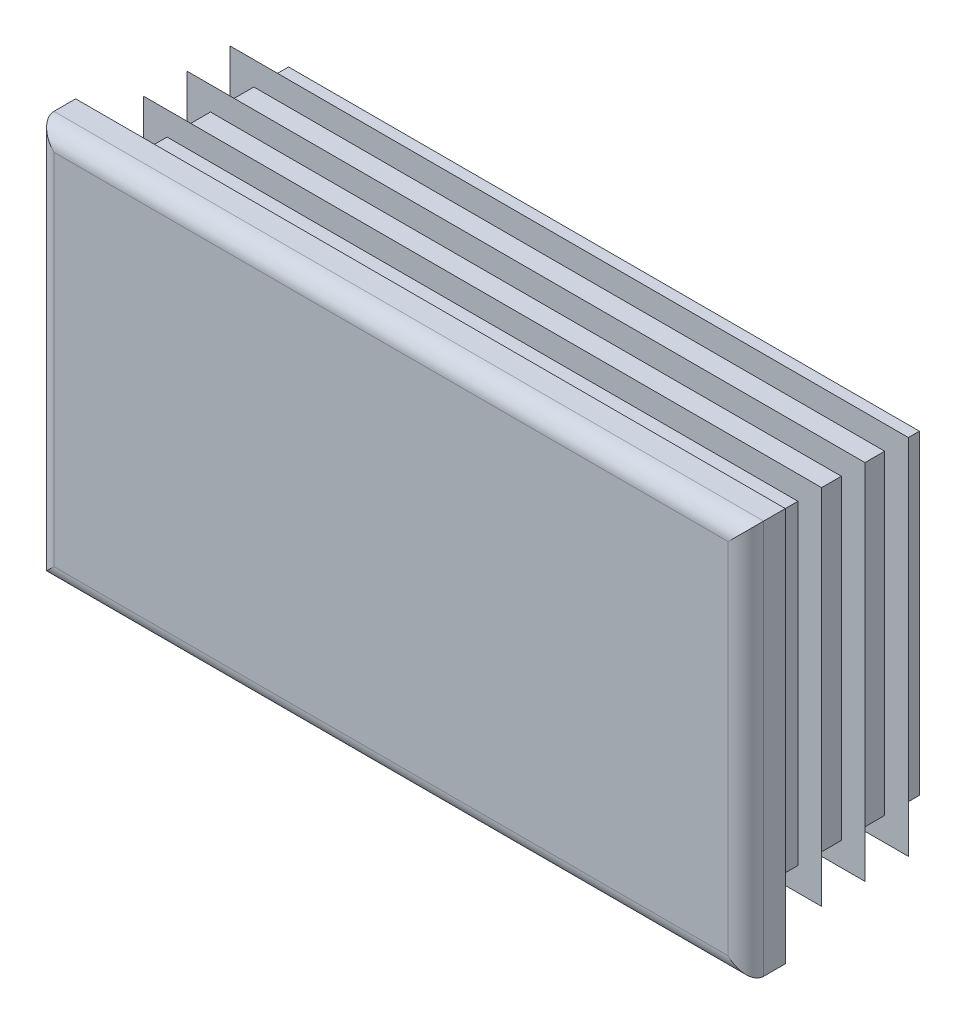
ISO-10303-21;
HEADER;
FILE_DESCRIPTION(('STEP AP214'),'2;1');
FILE_NAME('part.step','',(''),(''),'','','');
FILE_SCHEMA(('AUTOMOTIVE_DESIGN { 1 0 10303 214 1 1 1 1 }'));
ENDSEC;
DATA;
#1=APPLICATION_CONTEXT('core data for automotive mechanical design processes');
#2=APPLICATION_PROTOCOL_DEFINITION('international standard','automotive_design',2000,#1);
#3=PRODUCT_CONTEXT('',#1,'mechanical');
#4=PRODUCT('Part','Part','',(#3));
#5=PRODUCT_RELATED_PRODUCT_CATEGORY('part','',(#4));
#6=PRODUCT_DEFINITION_FORMATION('','',#4);
#7=PRODUCT_DEFINITION_CONTEXT('part definition',#1,'design');
#8=PRODUCT_DEFINITION('design','',#6,#7);
#9=PRODUCT_DEFINITION_SHAPE('','',#8);
#10=(LENGTH_UNIT() NAMED_UNIT(*) SI_UNIT(.MILLI.,.METRE.));
#11=(NAMED_UNIT(*) PLANE_ANGLE_UNIT() SI_UNIT($,.RADIAN.));
#12=(NAMED_UNIT(*) SI_UNIT($,.STERADIAN.) SOLID_ANGLE_UNIT());
#13=UNCERTAINTY_MEASURE_WITH_UNIT(LENGTH_MEASURE(1.E-05),#10,'distance_accuracy_value','');
#14=(GEOMETRIC_REPRESENTATION_CONTEXT(3) GLOBAL_UNCERTAINTY_ASSIGNED_CONTEXT((#13)) GLOBAL_UNIT_ASSIGNED_CONTEXT((#10,
#11,#12)) REPRESENTATION_CONTEXT('',''));
#15=CARTESIAN_POINT('',(0.,0.,0.));
#16=DIRECTION('',(0.,0.,1.));
#17=DIRECTION('',(1.,0.,0.));
#18=AXIS2_PLACEMENT_3D('',#15,#16,#17);
#19=CARTESIAN_POINT('',(42.75,-25.,5.));
#20=DIRECTION('',(0.,0.,-1.));
#21=DIRECTION('',(0.,1.,0.));
#22=AXIS2_PLACEMENT_3D('',#19,#20,#21);
#23=PLANE('',#22);
#24=DIRECTION('',(0.,1.,0.));
#25=VECTOR('',#24,1.);
#26=CARTESIAN_POINT('',(-42.75,-25.,5.));
#27=LINE('',#26,#25);
#28=CARTESIAN_POINT('',(-42.75,-22.75,5.));
#29=VERTEX_POINT('',#28);
#30=CARTESIAN_POINT('',(-42.75,22.75,5.));
#31=VERTEX_POINT('',#30);
#32=EDGE_CURVE('E310',#29,#31,#27,.T.);
#33=ORIENTED_EDGE('',*,*,#32,.F.);
#34=DIRECTION('',(-1.,0.,0.));
#35=VECTOR('',#34,1.);
#36=CARTESIAN_POINT('',(45.,-22.75,5.));
#37=LINE('',#36,#35);
#38=CARTESIAN_POINT('',(42.75,-22.75,5.));
#39=VERTEX_POINT('',#38);
#40=EDGE_CURVE('E482',#39,#29,#37,.T.);
#41=ORIENTED_EDGE('',*,*,#40,.F.);
#42=DIRECTION('',(0.,1.,0.));
#43=VECTOR('',#42,1.);
#44=CARTESIAN_POINT('',(42.75,-25.,5.));
#45=LINE('',#44,#43);
#46=CARTESIAN_POINT('',(42.75,22.75,5.));
#47=VERTEX_POINT('',#46);
#48=EDGE_CURVE('E305',#39,#47,#45,.T.);
#49=ORIENTED_EDGE('',*,*,#48,.T.);
#50=DIRECTION('',(-1.,0.,0.));
#51=VECTOR('',#50,1.);
#52=CARTESIAN_POINT('',(45.,22.75,5.));
#53=LINE('',#52,#51);
#54=EDGE_CURVE('E630',#47,#31,#53,.T.);
#55=ORIENTED_EDGE('',*,*,#54,.T.);
#56=EDGE_LOOP('',(#33,#41,#49,#55));
#57=FACE_BOUND('',#56,.T.);
#58=ADVANCED_FACE('F14',(#57),#23,.F.);
#59=CARTESIAN_POINT('',(-42.75,-25.,2.75));
#60=DIRECTION('',(0.,1.,0.));
#61=DIRECTION('',(-1.,0.,0.));
#62=AXIS2_PLACEMENT_3D('',#59,#60,#61);
#63=CYLINDRICAL_SURFACE('',#62,2.25);
#64=DIRECTION('',(0.,1.,0.));
#65=VECTOR('',#64,1.);
#66=CARTESIAN_POINT('',(-45.,-25.,2.75));
#67=LINE('',#66,#65);
#68=CARTESIAN_POINT('',(-45.,-25.,2.75));
#69=VERTEX_POINT('',#68);
#70=CARTESIAN_POINT('',(-45.,25.,2.75));
#71=VERTEX_POINT('',#70);
#72=EDGE_CURVE('E402',#69,#71,#67,.T.);
#73=ORIENTED_EDGE('',*,*,#72,.F.);
#74=CARTESIAN_POINT('',(-42.75,-22.75,2.75));
#75=DIRECTION('',(-0.707106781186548,0.707106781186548,0.));
#76=DIRECTION('',(0.707106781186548,0.707106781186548,0.));
#77=AXIS2_PLACEMENT_3D('',#74,#75,#76);
#78=ELLIPSE('',#77,3.18198051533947,2.25);
#79=EDGE_CURVE('E59',#69,#29,#78,.T.);
#80=ORIENTED_EDGE('',*,*,#79,.T.);
#81=ORIENTED_EDGE('',*,*,#32,.T.);
#82=CARTESIAN_POINT('',(-42.75,22.75,2.75));
#83=DIRECTION('',(0.707106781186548,0.707106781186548,0.));
#84=DIRECTION('',(-0.707106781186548,0.707106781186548,0.));
#85=AXIS2_PLACEMENT_3D('',#82,#83,#84);
#86=ELLIPSE('',#85,3.18198051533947,2.25);
#87=EDGE_CURVE('E306',#31,#71,#86,.F.);
#88=ORIENTED_EDGE('',*,*,#87,.T.);
#89=EDGE_LOOP('',(#73,#80,#81,#88));
#90=FACE_BOUND('',#89,.T.);
#91=ADVANCED_FACE('F16',(#90),#63,.T.);
#92=CARTESIAN_POINT('',(-45.,-25.,2.75));
#93=DIRECTION('',(1.,0.,0.));
#94=DIRECTION('',(0.,1.,0.));
#95=AXIS2_PLACEMENT_3D('',#92,#93,#94);
#96=PLANE('',#95);
#97=DIRECTION('',(0.,0.,-1.));
#98=VECTOR('',#97,1.);
#99=CARTESIAN_POINT('',(-45.,25.,2.75));
#100=LINE('',#99,#98);
#101=CARTESIAN_POINT('',(-45.,25.,0.));
#102=VERTEX_POINT('',#101);
#103=EDGE_CURVE('E615',#71,#102,#100,.T.);
#104=ORIENTED_EDGE('',*,*,#103,.T.);
#105=DIRECTION('',(0.,1.,0.));
#106=VECTOR('',#105,1.);
#107=CARTESIAN_POINT('',(-45.,-25.,0.));
#108=LINE('',#107,#106);
#109=CARTESIAN_POINT('',(-45.,-25.,0.));
#110=VERTEX_POINT('',#109);
#111=EDGE_CURVE('E400',#110,#102,#108,.T.);
#112=ORIENTED_EDGE('',*,*,#111,.F.);
#113=DIRECTION('',(0.,0.,-1.));
#114=VECTOR('',#113,1.);
#115=CARTESIAN_POINT('',(-45.,-25.,2.75));
#116=LINE('',#115,#114);
#117=EDGE_CURVE('E616',#69,#110,#116,.T.);
#118=ORIENTED_EDGE('',*,*,#117,.F.);
#119=ORIENTED_EDGE('',*,*,#72,.T.);
#120=EDGE_LOOP('',(#104,#112,#118,#119));
#121=FACE_BOUND('',#120,.T.);
#122=ADVANCED_FACE('F697',(#121),#96,.F.);
#123=CARTESIAN_POINT('',(-40.,-25.,0.));
#124=DIRECTION('',(1.,0.,0.));
#125=DIRECTION('',(0.,1.,0.));
#126=AXIS2_PLACEMENT_3D('',#123,#124,#125);
#127=PLANE('',#126);
#128=DIRECTION('',(0.,1.,0.));
#129=VECTOR('',#128,1.);
#130=CARTESIAN_POINT('',(-40.,-25.,0.));
#131=LINE('',#130,#129);
#132=CARTESIAN_POINT('',(-40.,-20.,0.));
#133=VERTEX_POINT('',#132);
#134=CARTESIAN_POINT('',(-40.,20.,0.));
#135=VERTEX_POINT('',#134);
#136=EDGE_CURVE('E397',#133,#135,#131,.T.);
#137=ORIENTED_EDGE('',*,*,#136,.T.);
#138=DIRECTION('',(0.,0.,-1.));
#139=VECTOR('',#138,1.);
#140=CARTESIAN_POINT('',(-40.,20.,0.));
#141=LINE('',#140,#139);
#142=CARTESIAN_POINT('',(-40.,20.,-1.1));
#143=VERTEX_POINT('',#142);
#144=EDGE_CURVE('E495',#135,#143,#141,.T.);
#145=ORIENTED_EDGE('',*,*,#144,.T.);
#146=DIRECTION('',(0.,1.,0.));
#147=VECTOR('',#146,1.);
#148=CARTESIAN_POINT('',(-40.,-25.,-1.1));
#149=LINE('',#148,#147);
#150=CARTESIAN_POINT('',(-40.,-20.,-1.1));
#151=VERTEX_POINT('',#150);
#152=EDGE_CURVE('E394',#151,#143,#149,.T.);
#153=ORIENTED_EDGE('',*,*,#152,.F.);
#154=DIRECTION('',(0.,0.,1.));
#155=VECTOR('',#154,1.);
#156=CARTESIAN_POINT('',(-40.,-20.,0.));
#157=LINE('',#156,#155);
#158=EDGE_CURVE('E489',#151,#133,#157,.T.);
#159=ORIENTED_EDGE('',*,*,#158,.T.);
#160=EDGE_LOOP('',(#137,#145,#153,#159));
#161=FACE_BOUND('',#160,.T.);
#162=ADVANCED_FACE('F787',(#161),#127,.F.);
#163=CARTESIAN_POINT('',(-43.,-25.,-1.1));
#164=DIRECTION('',(0.342020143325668,0.,0.939692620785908));
#165=DIRECTION('',(-0.939692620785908,0.,0.342020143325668));
#166=AXIS2_PLACEMENT_3D('',#163,#164,#165);
#167=PLANE('',#166);
#168=DIRECTION('',(0.,1.,0.));
#169=VECTOR('',#168,1.);
#170=CARTESIAN_POINT('',(-43.,-25.,-1.1));
#171=LINE('',#170,#169);
#172=CARTESIAN_POINT('',(-43.,-23.,-1.1));
#173=VERTEX_POINT('',#172);
#174=CARTESIAN_POINT('',(-43.,23.,-1.1));
#175=VERTEX_POINT('',#174);
#176=EDGE_CURVE('E392',#173,#175,#171,.T.);
#177=ORIENTED_EDGE('',*,*,#176,.T.);
#178=DIRECTION('',(0.844349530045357,-0.438895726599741,-0.307318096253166));
#179=VECTOR('',#178,1.);
#180=CARTESIAN_POINT('',(-25.2120927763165,13.7537859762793,-7.57426875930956));
#181=LINE('',#180,#179);
#182=CARTESIAN_POINT('',(-40.,21.4405899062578,-2.19191070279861));
#183=VERTEX_POINT('',#182);
#184=EDGE_CURVE('E519',#175,#183,#181,.T.);
#185=ORIENTED_EDGE('',*,*,#184,.T.);
#186=DIRECTION('',(0.,1.,0.));
#187=VECTOR('',#186,1.);
#188=CARTESIAN_POINT('',(-40.,-25.,-2.19191070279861));
#189=LINE('',#188,#187);
#190=CARTESIAN_POINT('',(-40.,-21.4405899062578,-2.19191070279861));
#191=VERTEX_POINT('',#190);
#192=EDGE_CURVE('E389',#191,#183,#189,.T.);
#193=ORIENTED_EDGE('',*,*,#192,.F.);
#194=DIRECTION('',(-0.844349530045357,-0.438895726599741,0.307318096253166));
#195=VECTOR('',#194,1.);
#196=CARTESIAN_POINT('',(-43.7411628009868,-23.3852589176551,-0.830238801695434));
#197=LINE('',#196,#195);
#198=EDGE_CURVE('E507',#191,#173,#197,.T.);
#199=ORIENTED_EDGE('',*,*,#198,.T.);
#200=EDGE_LOOP('',(#177,#185,#193,#199));
#201=FACE_BOUND('',#200,.T.);
#202=ADVANCED_FACE('F783',(#201),#167,.F.);
#203=CARTESIAN_POINT('',(-40.,-25.,-2.19191070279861));
#204=DIRECTION('',(1.,0.,0.));
#205=DIRECTION('',(0.,1.,0.));
#206=AXIS2_PLACEMENT_3D('',#203,#204,#205);
#207=PLANE('',#206);
#208=ORIENTED_EDGE('',*,*,#192,.T.);
#209=DIRECTION('',(0.,-0.819152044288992,-0.573576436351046));
#210=VECTOR('',#209,1.);
#211=CARTESIAN_POINT('',(-40.,-9.72151365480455,-24.0118505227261));
#212=LINE('',#211,#210);
#213=CARTESIAN_POINT('',(-40.,20.,-3.20062261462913));
#214=VERTEX_POINT('',#213);
#215=EDGE_CURVE('E516',#183,#214,#212,.T.);
#216=ORIENTED_EDGE('',*,*,#215,.T.);
#217=DIRECTION('',(0.,0.,-1.));
#218=VECTOR('',#217,1.);
#219=CARTESIAN_POINT('',(-40.,20.,-2.19191070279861));
#220=LINE('',#219,#218);
#221=CARTESIAN_POINT('',(-40.,20.,-6.6));
#222=VERTEX_POINT('',#221);
#223=EDGE_CURVE('E525',#214,#222,#220,.T.);
#224=ORIENTED_EDGE('',*,*,#223,.T.);
#225=DIRECTION('',(0.,1.,0.));
#226=VECTOR('',#225,1.);
#227=CARTESIAN_POINT('',(-40.,-25.,-6.6));
#228=LINE('',#227,#226);
#229=CARTESIAN_POINT('',(-40.,-20.,-6.6));
#230=VERTEX_POINT('',#229);
#231=EDGE_CURVE('E386',#230,#222,#228,.T.);
#232=ORIENTED_EDGE('',*,*,#231,.F.);
#233=DIRECTION('',(0.,0.,1.));
#234=VECTOR('',#233,1.);
#235=CARTESIAN_POINT('',(-40.,-20.,-2.19191070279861));
#236=LINE('',#235,#234);
#237=CARTESIAN_POINT('',(-40.,-20.,-3.20062261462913));
#238=VERTEX_POINT('',#237);
#239=EDGE_CURVE('E522',#230,#238,#236,.T.);
#240=ORIENTED_EDGE('',*,*,#239,.T.);
#241=DIRECTION('',(0.,-0.819152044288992,0.573576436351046));
#242=VECTOR('',#241,1.);
#243=CARTESIAN_POINT('',(-40.,-23.8289899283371,-0.519535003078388));
#244=LINE('',#243,#242);
#245=EDGE_CURVE('E504',#238,#191,#244,.T.);
#246=ORIENTED_EDGE('',*,*,#245,.T.);
#247=EDGE_LOOP('',(#208,#216,#224,#232,#240,#246));
#248=FACE_BOUND('',#247,.T.);
#249=ADVANCED_FACE('F779',(#248),#207,.F.);
#250=CARTESIAN_POINT('',(-43.,-25.,-6.6));
#251=DIRECTION('',(0.342020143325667,0.,0.939692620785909));
#252=DIRECTION('',(-0.939692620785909,0.,0.342020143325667));
#253=AXIS2_PLACEMENT_3D('',#250,#251,#252);
#254=PLANE('',#253);
#255=DIRECTION('',(0.,1.,0.));
#256=VECTOR('',#255,1.);
#257=CARTESIAN_POINT('',(-43.,-25.,-6.6));
#258=LINE('',#257,#256);
#259=CARTESIAN_POINT('',(-43.,-23.,-6.6));
#260=VERTEX_POINT('',#259);
#261=CARTESIAN_POINT('',(-43.,23.,-6.6));
#262=VERTEX_POINT('',#261);
#263=EDGE_CURVE('E384',#260,#262,#258,.T.);
#264=ORIENTED_EDGE('',*,*,#263,.T.);
#265=DIRECTION('',(0.844349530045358,-0.438895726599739,-0.307318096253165));
#266=VECTOR('',#265,1.);
#267=CARTESIAN_POINT('',(-25.2120927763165,13.7537859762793,-13.0742687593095));
#268=LINE('',#267,#266);
#269=CARTESIAN_POINT('',(-40.,21.4405899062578,-7.69191070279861));
#270=VERTEX_POINT('',#269);
#271=EDGE_CURVE('E549',#262,#270,#268,.T.);
#272=ORIENTED_EDGE('',*,*,#271,.T.);
#273=DIRECTION('',(0.,1.,0.));
#274=VECTOR('',#273,1.);
#275=CARTESIAN_POINT('',(-40.,-25.,-7.6919107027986));
#276=LINE('',#275,#274);
#277=CARTESIAN_POINT('',(-40.,-21.4405899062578,-7.6919107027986));
#278=VERTEX_POINT('',#277);
#279=EDGE_CURVE('E381',#278,#270,#276,.T.);
#280=ORIENTED_EDGE('',*,*,#279,.F.);
#281=DIRECTION('',(-0.844349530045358,-0.438895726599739,0.307318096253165));
#282=VECTOR('',#281,1.);
#283=CARTESIAN_POINT('',(-43.7411628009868,-23.3852589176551,-6.33023880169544));
#284=LINE('',#283,#282);
#285=EDGE_CURVE('E537',#278,#260,#284,.T.);
#286=ORIENTED_EDGE('',*,*,#285,.T.);
#287=EDGE_LOOP('',(#264,#272,#280,#286));
#288=FACE_BOUND('',#287,.T.);
#289=ADVANCED_FACE('F775',(#288),#254,.F.);
#290=CARTESIAN_POINT('',(-40.,-25.,-7.6919107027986));
#291=DIRECTION('',(1.,0.,0.));
#292=DIRECTION('',(0.,1.,0.));
#293=AXIS2_PLACEMENT_3D('',#290,#291,#292);
#294=PLANE('',#293);
#295=ORIENTED_EDGE('',*,*,#279,.T.);
#296=DIRECTION('',(0.,-0.819152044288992,-0.573576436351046));
#297=VECTOR('',#296,1.);
#298=CARTESIAN_POINT('',(-40.,-9.72151365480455,-29.5118505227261));
#299=LINE('',#298,#297);
#300=CARTESIAN_POINT('',(-40.,20.,-8.70062261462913));
#301=VERTEX_POINT('',#300);
#302=EDGE_CURVE('E546',#270,#301,#299,.T.);
#303=ORIENTED_EDGE('',*,*,#302,.T.);
#304=DIRECTION('',(0.,0.,-1.));
#305=VECTOR('',#304,1.);
#306=CARTESIAN_POINT('',(-40.,20.,-7.6919107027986));
#307=LINE('',#306,#305);
#308=CARTESIAN_POINT('',(-40.,20.,-12.1));
#309=VERTEX_POINT('',#308);
#310=EDGE_CURVE('E555',#301,#309,#307,.T.);
#311=ORIENTED_EDGE('',*,*,#310,.T.);
#312=DIRECTION('',(0.,1.,0.));
#313=VECTOR('',#312,1.);
#314=CARTESIAN_POINT('',(-40.,-25.,-12.1));
#315=LINE('',#314,#313);
#316=CARTESIAN_POINT('',(-40.,-20.,-12.1));
#317=VERTEX_POINT('',#316);
#318=EDGE_CURVE('E378',#317,#309,#315,.T.);
#319=ORIENTED_EDGE('',*,*,#318,.F.);
#320=DIRECTION('',(0.,0.,1.));
#321=VECTOR('',#320,1.);
#322=CARTESIAN_POINT('',(-40.,-20.,-7.6919107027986));
#323=LINE('',#322,#321);
#324=CARTESIAN_POINT('',(-40.,-20.,-8.70062261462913));
#325=VERTEX_POINT('',#324);
#326=EDGE_CURVE('E552',#317,#325,#323,.T.);
#327=ORIENTED_EDGE('',*,*,#326,.T.);
#328=DIRECTION('',(0.,-0.819152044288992,0.573576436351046));
#329=VECTOR('',#328,1.);
#330=CARTESIAN_POINT('',(-40.,-23.8289899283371,-6.01953500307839));
#331=LINE('',#330,#329);
#332=EDGE_CURVE('E534',#325,#278,#331,.T.);
#333=ORIENTED_EDGE('',*,*,#332,.T.);
#334=EDGE_LOOP('',(#295,#303,#311,#319,#327,#333));
#335=FACE_BOUND('',#334,.T.);
#336=ADVANCED_FACE('F771',(#335),#294,.F.);
#337=CARTESIAN_POINT('',(-43.,-25.,-12.1));
#338=DIRECTION('',(0.342020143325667,0.,0.939692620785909));
#339=DIRECTION('',(-0.939692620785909,0.,0.342020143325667));
#340=AXIS2_PLACEMENT_3D('',#337,#338,#339);
#341=PLANE('',#340);
#342=DIRECTION('',(0.,1.,0.));
#343=VECTOR('',#342,1.);
#344=CARTESIAN_POINT('',(-43.,-25.,-12.1));
#345=LINE('',#344,#343);
#346=CARTESIAN_POINT('',(-43.,-23.,-12.1));
#347=VERTEX_POINT('',#346);
#348=CARTESIAN_POINT('',(-43.,23.,-12.1));
#349=VERTEX_POINT('',#348);
#350=EDGE_CURVE('E376',#347,#349,#345,.T.);
#351=ORIENTED_EDGE('',*,*,#350,.T.);
#352=DIRECTION('',(0.844349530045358,-0.438895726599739,-0.307318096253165));
#353=VECTOR('',#352,1.);
#354=CARTESIAN_POINT('',(-25.2120927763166,13.7537859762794,-18.5742687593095));
#355=LINE('',#354,#353);
#356=CARTESIAN_POINT('',(-40.,21.4405899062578,-13.1919107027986));
#357=VERTEX_POINT('',#356);
#358=EDGE_CURVE('E579',#349,#357,#355,.T.);
#359=ORIENTED_EDGE('',*,*,#358,.T.);
#360=DIRECTION('',(0.,1.,0.));
#361=VECTOR('',#360,1.);
#362=CARTESIAN_POINT('',(-40.,-25.,-13.1919107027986));
#363=LINE('',#362,#361);
#364=CARTESIAN_POINT('',(-40.,-21.4405899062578,-13.1919107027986));
#365=VERTEX_POINT('',#364);
#366=EDGE_CURVE('E373',#365,#357,#363,.T.);
#367=ORIENTED_EDGE('',*,*,#366,.F.);
#368=DIRECTION('',(-0.844349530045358,-0.438895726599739,0.307318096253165));
#369=VECTOR('',#368,1.);
#370=CARTESIAN_POINT('',(-43.7411628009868,-23.3852589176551,-11.8302388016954));
#371=LINE('',#370,#369);
#372=EDGE_CURVE('E567',#365,#347,#371,.T.);
#373=ORIENTED_EDGE('',*,*,#372,.T.);
#374=EDGE_LOOP('',(#351,#359,#367,#373));
#375=FACE_BOUND('',#374,.T.);
#376=ADVANCED_FACE('F767',(#375),#341,.F.);
#377=CARTESIAN_POINT('',(-40.,-25.,-13.1919107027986));
#378=DIRECTION('',(1.,0.,0.));
#379=DIRECTION('',(0.,1.,0.));
#380=AXIS2_PLACEMENT_3D('',#377,#378,#379);
#381=PLANE('',#380);
#382=ORIENTED_EDGE('',*,*,#366,.T.);
#383=DIRECTION('',(0.,-0.819152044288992,-0.573576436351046));
#384=VECTOR('',#383,1.);
#385=CARTESIAN_POINT('',(-40.,-9.72151365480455,-35.0118505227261));
#386=LINE('',#385,#384);
#387=CARTESIAN_POINT('',(-40.,20.,-14.2006226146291));
#388=VERTEX_POINT('',#387);
#389=EDGE_CURVE('E576',#357,#388,#386,.T.);
#390=ORIENTED_EDGE('',*,*,#389,.T.);
#391=DIRECTION('',(0.,0.,-1.));
#392=VECTOR('',#391,1.);
#393=CARTESIAN_POINT('',(-40.,20.,-13.1919107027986));
#394=LINE('',#393,#392);
#395=CARTESIAN_POINT('',(-40.,20.,-17.6));
#396=VERTEX_POINT('',#395);
#397=EDGE_CURVE('E585',#388,#396,#394,.T.);
#398=ORIENTED_EDGE('',*,*,#397,.T.);
#399=DIRECTION('',(0.,1.,0.));
#400=VECTOR('',#399,1.);
#401=CARTESIAN_POINT('',(-40.,-25.,-17.6));
#402=LINE('',#401,#400);
#403=CARTESIAN_POINT('',(-40.,-20.,-17.6));
#404=VERTEX_POINT('',#403);
#405=EDGE_CURVE('E370',#404,#396,#402,.T.);
#406=ORIENTED_EDGE('',*,*,#405,.F.);
#407=DIRECTION('',(0.,0.,1.));
#408=VECTOR('',#407,1.);
#409=CARTESIAN_POINT('',(-40.,-20.,-13.1919107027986));
#410=LINE('',#409,#408);
#411=CARTESIAN_POINT('',(-40.,-20.,-14.2006226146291));
#412=VERTEX_POINT('',#411);
#413=EDGE_CURVE('E582',#404,#412,#410,.T.);
#414=ORIENTED_EDGE('',*,*,#413,.T.);
#415=DIRECTION('',(0.,-0.819152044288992,0.573576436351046));
#416=VECTOR('',#415,1.);
#417=CARTESIAN_POINT('',(-40.,-23.8289899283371,-11.5195350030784));
#418=LINE('',#417,#416);
#419=EDGE_CURVE('E564',#412,#365,#418,.T.);
#420=ORIENTED_EDGE('',*,*,#419,.T.);
#421=EDGE_LOOP('',(#382,#390,#398,#406,#414,#420));
#422=FACE_BOUND('',#421,.T.);
#423=ADVANCED_FACE('F764',(#422),#381,.F.);
#424=CARTESIAN_POINT('',(-43.,-25.,-17.6));
#425=DIRECTION('',(0.342020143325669,0.,0.939692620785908));
#426=DIRECTION('',(-0.939692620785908,0.,0.342020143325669));
#427=AXIS2_PLACEMENT_3D('',#424,#425,#426);
#428=PLANE('',#427);
#429=DIRECTION('',(0.,1.,0.));
#430=VECTOR('',#429,1.);
#431=CARTESIAN_POINT('',(-43.,-25.,-17.6));
#432=LINE('',#431,#430);
#433=CARTESIAN_POINT('',(-43.,-23.,-17.6));
#434=VERTEX_POINT('',#433);
#435=CARTESIAN_POINT('',(-43.,23.,-17.6));
#436=VERTEX_POINT('',#435);
#437=EDGE_CURVE('E368',#434,#436,#432,.T.);
#438=ORIENTED_EDGE('',*,*,#437,.T.);
#439=DIRECTION('',(0.844349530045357,-0.438895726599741,-0.307318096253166));
#440=VECTOR('',#439,1.);
#441=CARTESIAN_POINT('',(-25.2120927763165,13.7537859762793,-24.0742687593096));
#442=LINE('',#441,#440);
#443=CARTESIAN_POINT('',(-40.,21.4405899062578,-18.6919107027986));
#444=VERTEX_POINT('',#443);
#445=EDGE_CURVE('E607',#436,#444,#442,.T.);
#446=ORIENTED_EDGE('',*,*,#445,.T.);
#447=DIRECTION('',(0.,1.,0.));
#448=VECTOR('',#447,1.);
#449=CARTESIAN_POINT('',(-40.,-25.,-18.6919107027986));
#450=LINE('',#449,#448);
#451=CARTESIAN_POINT('',(-40.,-21.4405899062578,-18.6919107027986));
#452=VERTEX_POINT('',#451);
#453=EDGE_CURVE('E365',#452,#444,#450,.T.);
#454=ORIENTED_EDGE('',*,*,#453,.F.);
#455=DIRECTION('',(-0.844349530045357,-0.438895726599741,0.307318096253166));
#456=VECTOR('',#455,1.);
#457=CARTESIAN_POINT('',(-43.7411628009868,-23.3852589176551,-17.3302388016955));
#458=LINE('',#457,#456);
#459=EDGE_CURVE('E595',#452,#434,#458,.T.);
#460=ORIENTED_EDGE('',*,*,#459,.T.);
#461=EDGE_LOOP('',(#438,#446,#454,#460));
#462=FACE_BOUND('',#461,.T.);
#463=ADVANCED_FACE('F675',(#462),#428,.F.);
#464=CARTESIAN_POINT('',(-40.,-25.,-18.6919107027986));
#465=DIRECTION('',(1.,0.,0.));
#466=DIRECTION('',(0.,1.,0.));
#467=AXIS2_PLACEMENT_3D('',#464,#465,#466);
#468=PLANE('',#467);
#469=ORIENTED_EDGE('',*,*,#453,.T.);
#470=DIRECTION('',(0.,-0.819152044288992,-0.573576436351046));
#471=VECTOR('',#470,1.);
#472=CARTESIAN_POINT('',(-40.,-9.72151365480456,-40.5118505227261));
#473=LINE('',#472,#471);
#474=CARTESIAN_POINT('',(-40.,20.,-19.7006226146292));
#475=VERTEX_POINT('',#474);
#476=EDGE_CURVE('E604',#444,#475,#473,.T.);
#477=ORIENTED_EDGE('',*,*,#476,.T.);
#478=DIRECTION('',(0.,0.,-1.));
#479=VECTOR('',#478,1.);
#480=CARTESIAN_POINT('',(-40.,20.,-18.6919107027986));
#481=LINE('',#480,#479);
#482=CARTESIAN_POINT('',(-40.,20.,-22.));
#483=VERTEX_POINT('',#482);
#484=EDGE_CURVE('E613',#475,#483,#481,.T.);
#485=ORIENTED_EDGE('',*,*,#484,.T.);
#486=DIRECTION('',(0.,1.,0.));
#487=VECTOR('',#486,1.);
#488=CARTESIAN_POINT('',(-40.,-25.,-22.));
#489=LINE('',#488,#487);
#490=CARTESIAN_POINT('',(-40.,-20.,-22.));
#491=VERTEX_POINT('',#490);
#492=EDGE_CURVE('E362',#491,#483,#489,.T.);
#493=ORIENTED_EDGE('',*,*,#492,.F.);
#494=DIRECTION('',(0.,0.,1.));
#495=VECTOR('',#494,1.);
#496=CARTESIAN_POINT('',(-40.,-20.,-18.6919107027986));
#497=LINE('',#496,#495);
#498=CARTESIAN_POINT('',(-40.,-20.,-19.7006226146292));
#499=VERTEX_POINT('',#498);
#500=EDGE_CURVE('E610',#491,#499,#497,.T.);
#501=ORIENTED_EDGE('',*,*,#500,.T.);
#502=DIRECTION('',(0.,-0.819152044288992,0.573576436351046));
#503=VECTOR('',#502,1.);
#504=CARTESIAN_POINT('',(-40.,-23.8289899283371,-17.0195350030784));
#505=LINE('',#504,#503);
#506=EDGE_CURVE('E592',#499,#452,#505,.T.);
#507=ORIENTED_EDGE('',*,*,#506,.T.);
#508=EDGE_LOOP('',(#469,#477,#485,#493,#501,#507));
#509=FACE_BOUND('',#508,.T.);
#510=ADVANCED_FACE('F677',(#509),#468,.F.);
#511=CARTESIAN_POINT('',(-40.,-25.,-22.));
#512=DIRECTION('',(0.,0.,1.));
#513=DIRECTION('',(0.,-1.,0.));
#514=AXIS2_PLACEMENT_3D('',#511,#512,#513);
#515=PLANE('',#514);
#516=ORIENTED_EDGE('',*,*,#492,.T.);
#517=DIRECTION('',(-1.,0.,0.));
#518=VECTOR('',#517,1.);
#519=CARTESIAN_POINT('',(45.,20.,-22.));
#520=LINE('',#519,#518);
#521=CARTESIAN_POINT('',(40.,20.,-22.));
#522=VERTEX_POINT('',#521);
#523=EDGE_CURVE('E438',#522,#483,#520,.T.);
#524=ORIENTED_EDGE('',*,*,#523,.F.);
#525=DIRECTION('',(0.,1.,0.));
#526=VECTOR('',#525,1.);
#527=CARTESIAN_POINT('',(40.,-25.,-22.));
#528=LINE('',#527,#526);
#529=CARTESIAN_POINT('',(40.,-20.,-22.));
#530=VERTEX_POINT('',#529);
#531=EDGE_CURVE('E359',#530,#522,#528,.T.);
#532=ORIENTED_EDGE('',*,*,#531,.F.);
#533=DIRECTION('',(-1.,0.,0.));
#534=VECTOR('',#533,1.);
#535=CARTESIAN_POINT('',(45.,-20.,-22.));
#536=LINE('',#535,#534);
#537=EDGE_CURVE('E436',#530,#491,#536,.T.);
#538=ORIENTED_EDGE('',*,*,#537,.T.);
#539=EDGE_LOOP('',(#516,#524,#532,#538));
#540=FACE_BOUND('',#539,.T.);
#541=ADVANCED_FACE('F435',(#540),#515,.F.);
#542=CARTESIAN_POINT('',(40.,-25.,-22.));
#543=DIRECTION('',(-1.,0.,0.));
#544=DIRECTION('',(0.,-1.,0.));
#545=AXIS2_PLACEMENT_3D('',#542,#543,#544);
#546=PLANE('',#545);
#547=DIRECTION('',(0.,0.,1.));
#548=VECTOR('',#547,1.);
#549=CARTESIAN_POINT('',(40.,20.,-22.));
#550=LINE('',#549,#548);
#551=CARTESIAN_POINT('',(40.,20.,-19.7006226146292));
#552=VERTEX_POINT('',#551);
#553=EDGE_CURVE('E9',#522,#552,#550,.T.);
#554=ORIENTED_EDGE('',*,*,#553,.T.);
#555=DIRECTION('',(0.,0.819152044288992,0.573576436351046));
#556=VECTOR('',#555,1.);
#557=CARTESIAN_POINT('',(40.,-11.275807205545,-41.6001785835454));
#558=LINE('',#557,#556);
#559=CARTESIAN_POINT('',(40.,21.4405899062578,-18.6919107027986));
#560=VERTEX_POINT('',#559);
#561=EDGE_CURVE('E601',#552,#560,#558,.T.);
#562=ORIENTED_EDGE('',*,*,#561,.T.);
#563=DIRECTION('',(0.,1.,0.));
#564=VECTOR('',#563,1.);
#565=CARTESIAN_POINT('',(40.,-25.,-18.6919107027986));
#566=LINE('',#565,#564);
#567=CARTESIAN_POINT('',(40.,-21.4405899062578,-18.6919107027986));
#568=VERTEX_POINT('',#567);
#569=EDGE_CURVE('E356',#568,#560,#566,.T.);
#570=ORIENTED_EDGE('',*,*,#569,.F.);
#571=DIRECTION('',(0.,0.819152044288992,-0.573576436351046));
#572=VECTOR('',#571,1.);
#573=CARTESIAN_POINT('',(40.,-22.2746963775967,-18.1078630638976));
#574=LINE('',#573,#572);
#575=CARTESIAN_POINT('',(40.,-20.,-19.7006226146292));
#576=VERTEX_POINT('',#575);
#577=EDGE_CURVE('E428',#568,#576,#574,.T.);
#578=ORIENTED_EDGE('',*,*,#577,.T.);
#579=DIRECTION('',(0.,0.,-1.));
#580=VECTOR('',#579,1.);
#581=CARTESIAN_POINT('',(40.,-20.,-22.));
#582=LINE('',#581,#580);
#583=EDGE_CURVE('E23',#576,#530,#582,.T.);
#584=ORIENTED_EDGE('',*,*,#583,.T.);
#585=ORIENTED_EDGE('',*,*,#531,.T.);
#586=EDGE_LOOP('',(#554,#562,#570,#578,#584,#585));
#587=FACE_BOUND('',#586,.T.);
#588=ADVANCED_FACE('F426',(#587),#546,.F.);
#589=CARTESIAN_POINT('',(40.,-25.,-18.6919107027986));
#590=DIRECTION('',(-0.342020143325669,0.,0.939692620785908));
#591=DIRECTION('',(-0.939692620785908,0.,-0.342020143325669));
#592=AXIS2_PLACEMENT_3D('',#589,#590,#591);
#593=PLANE('',#592);
#594=ORIENTED_EDGE('',*,*,#569,.T.);
#595=DIRECTION('',(0.844349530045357,0.438895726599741,0.307318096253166));
#596=VECTOR('',#595,1.);
#597=CARTESIAN_POINT('',(22.789981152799,12.4947642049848,-24.9558452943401));
#598=LINE('',#597,#596);
#599=CARTESIAN_POINT('',(43.,23.,-17.6));
#600=VERTEX_POINT('',#599);
#601=EDGE_CURVE('E598',#560,#600,#598,.T.);
#602=ORIENTED_EDGE('',*,*,#601,.T.);
#603=DIRECTION('',(0.,1.,0.));
#604=VECTOR('',#603,1.);
#605=CARTESIAN_POINT('',(43.,-25.,-17.6));
#606=LINE('',#605,#604);
#607=CARTESIAN_POINT('',(43.,-23.,-17.6));
#608=VERTEX_POINT('',#607);
#609=EDGE_CURVE('E353',#608,#600,#606,.T.);
#610=ORIENTED_EDGE('',*,*,#609,.F.);
#611=DIRECTION('',(-0.844349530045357,0.438895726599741,-0.307318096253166));
#612=VECTOR('',#611,1.);
#613=CARTESIAN_POINT('',(41.3190511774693,-22.1262371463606,-18.211815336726));
#614=LINE('',#613,#612);
#615=EDGE_CURVE('E588',#608,#568,#614,.T.);
#616=ORIENTED_EDGE('',*,*,#615,.T.);
#617=EDGE_LOOP('',(#594,#602,#610,#616));
#618=FACE_BOUND('',#617,.T.);
#619=ADVANCED_FACE('F752',(#618),#593,.F.);
#620=CARTESIAN_POINT('',(43.,-25.,-17.6));
#621=DIRECTION('',(0.,0.,-1.));
#622=DIRECTION('',(0.,1.,0.));
#623=AXIS2_PLACEMENT_3D('',#620,#621,#622);
#624=PLANE('',#623);
#625=ORIENTED_EDGE('',*,*,#609,.T.);
#626=DIRECTION('',(-1.,0.,0.));
#627=VECTOR('',#626,1.);
#628=CARTESIAN_POINT('',(45.,23.,-17.6));
#629=LINE('',#628,#627);
#630=EDGE_CURVE('E444',#600,#436,#629,.T.);
#631=ORIENTED_EDGE('',*,*,#630,.T.);
#632=ORIENTED_EDGE('',*,*,#437,.F.);
#633=DIRECTION('',(-1.,0.,0.));
#634=VECTOR('',#633,1.);
#635=CARTESIAN_POINT('',(45.,-23.,-17.6));
#636=LINE('',#635,#634);
#637=EDGE_CURVE('E451',#608,#434,#636,.T.);
#638=ORIENTED_EDGE('',*,*,#637,.F.);
#639=EDGE_LOOP('',(#625,#631,#632,#638));
#640=FACE_BOUND('',#639,.T.);
#641=ORIENTED_EDGE('',*,*,#405,.T.);
#642=DIRECTION('',(-1.,0.,0.));
#643=VECTOR('',#642,1.);
#644=CARTESIAN_POINT('',(45.,20.,-17.6));
#645=LINE('',#644,#643);
#646=CARTESIAN_POINT('',(40.,20.,-17.6));
#647=VERTEX_POINT('',#646);
#648=EDGE_CURVE('E663',#647,#396,#645,.T.);
#649=ORIENTED_EDGE('',*,*,#648,.F.);
#650=DIRECTION('',(0.,1.,0.));
#651=VECTOR('',#650,1.);
#652=CARTESIAN_POINT('',(40.,-25.,-17.6));
#653=LINE('',#652,#651);
#654=CARTESIAN_POINT('',(40.,-20.,-17.6));
#655=VERTEX_POINT('',#654);
#656=EDGE_CURVE('E350',#655,#647,#653,.T.);
#657=ORIENTED_EDGE('',*,*,#656,.F.);
#658=DIRECTION('',(-1.,0.,0.));
#659=VECTOR('',#658,1.);
#660=CARTESIAN_POINT('',(45.,-20.,-17.6));
#661=LINE('',#660,#659);
#662=EDGE_CURVE('E453',#655,#404,#661,.T.);
#663=ORIENTED_EDGE('',*,*,#662,.T.);
#664=EDGE_LOOP('',(#641,#649,#657,#663));
#665=FACE_BOUND('',#664,.T.);
#666=ADVANCED_FACE('F667',(#640,#665),#624,.F.);
#667=CARTESIAN_POINT('',(40.,-25.,-17.6));
#668=DIRECTION('',(-1.,0.,0.));
#669=DIRECTION('',(0.,-1.,0.));
#670=AXIS2_PLACEMENT_3D('',#667,#668,#669);
#671=PLANE('',#670);
#672=DIRECTION('',(0.,0.,1.));
#673=VECTOR('',#672,1.);
#674=CARTESIAN_POINT('',(40.,20.,-17.6));
#675=LINE('',#674,#673);
#676=CARTESIAN_POINT('',(40.,20.,-14.2006226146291));
#677=VERTEX_POINT('',#676);
#678=EDGE_CURVE('E420',#647,#677,#675,.T.);
#679=ORIENTED_EDGE('',*,*,#678,.T.);
#680=DIRECTION('',(0.,0.819152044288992,0.573576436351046));
#681=VECTOR('',#680,1.);
#682=CARTESIAN_POINT('',(40.,-11.7926381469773,-36.4620675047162));
#683=LINE('',#682,#681);
#684=CARTESIAN_POINT('',(40.,21.4405899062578,-13.1919107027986));
#685=VERTEX_POINT('',#684);
#686=EDGE_CURVE('E573',#677,#685,#683,.T.);
#687=ORIENTED_EDGE('',*,*,#686,.T.);
#688=DIRECTION('',(0.,1.,0.));
#689=VECTOR('',#688,1.);
#690=CARTESIAN_POINT('',(40.,-25.,-13.1919107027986));
#691=LINE('',#690,#689);
#692=CARTESIAN_POINT('',(40.,-21.4405899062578,-13.1919107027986));
#693=VERTEX_POINT('',#692);
#694=EDGE_CURVE('E347',#693,#685,#691,.T.);
#695=ORIENTED_EDGE('',*,*,#694,.F.);
#696=DIRECTION('',(0.,0.819152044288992,-0.573576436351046));
#697=VECTOR('',#696,1.);
#698=CARTESIAN_POINT('',(40.,-21.7578654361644,-12.9697519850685));
#699=LINE('',#698,#697);
#700=CARTESIAN_POINT('',(40.,-20.,-14.2006226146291));
#701=VERTEX_POINT('',#700);
#702=EDGE_CURVE('E561',#693,#701,#699,.T.);
#703=ORIENTED_EDGE('',*,*,#702,.T.);
#704=DIRECTION('',(0.,0.,-1.));
#705=VECTOR('',#704,1.);
#706=CARTESIAN_POINT('',(40.,-20.,-17.6));
#707=LINE('',#706,#705);
#708=EDGE_CURVE('E417',#701,#655,#707,.T.);
#709=ORIENTED_EDGE('',*,*,#708,.T.);
#710=ORIENTED_EDGE('',*,*,#656,.T.);
#711=EDGE_LOOP('',(#679,#687,#695,#703,#709,#710));
#712=FACE_BOUND('',#711,.T.);
#713=ADVANCED_FACE('F745',(#712),#671,.F.);
#714=CARTESIAN_POINT('',(40.,-25.,-13.1919107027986));
#715=DIRECTION('',(-0.342020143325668,0.,0.939692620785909));
#716=DIRECTION('',(-0.939692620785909,0.,-0.342020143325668));
#717=AXIS2_PLACEMENT_3D('',#714,#715,#716);
#718=PLANE('',#717);
#719=ORIENTED_EDGE('',*,*,#694,.T.);
#720=DIRECTION('',(0.844349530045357,0.43889572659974,0.307318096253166));
#721=VECTOR('',#720,1.);
#722=CARTESIAN_POINT('',(22.789981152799,12.4947642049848,-19.4558452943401));
#723=LINE('',#722,#721);
#724=CARTESIAN_POINT('',(43.,23.,-12.1));
#725=VERTEX_POINT('',#724);
#726=EDGE_CURVE('E570',#685,#725,#723,.T.);
#727=ORIENTED_EDGE('',*,*,#726,.T.);
#728=DIRECTION('',(0.,1.,0.));
#729=VECTOR('',#728,1.);
#730=CARTESIAN_POINT('',(43.,-25.,-12.1));
#731=LINE('',#730,#729);
#732=CARTESIAN_POINT('',(43.,-23.,-12.1));
#733=VERTEX_POINT('',#732);
#734=EDGE_CURVE('E344',#733,#725,#731,.T.);
#735=ORIENTED_EDGE('',*,*,#734,.F.);
#736=DIRECTION('',(-0.844349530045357,0.43889572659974,-0.307318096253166));
#737=VECTOR('',#736,1.);
#738=CARTESIAN_POINT('',(41.3190511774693,-22.1262371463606,-12.711815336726));
#739=LINE('',#738,#737);
#740=EDGE_CURVE('E558',#733,#693,#739,.T.);
#741=ORIENTED_EDGE('',*,*,#740,.T.);
#742=EDGE_LOOP('',(#719,#727,#735,#741));
#743=FACE_BOUND('',#742,.T.);
#744=ADVANCED_FACE('F741',(#743),#718,.F.);
#745=CARTESIAN_POINT('',(43.,-25.,-12.1));
#746=DIRECTION('',(0.,0.,-1.));
#747=DIRECTION('',(0.,1.,0.));
#748=AXIS2_PLACEMENT_3D('',#745,#746,#747);
#749=PLANE('',#748);
#750=ORIENTED_EDGE('',*,*,#734,.T.);
#751=DIRECTION('',(-1.,0.,0.));
#752=VECTOR('',#751,1.);
#753=CARTESIAN_POINT('',(45.,23.,-12.1));
#754=LINE('',#753,#752);
#755=EDGE_CURVE('E657',#725,#349,#754,.T.);
#756=ORIENTED_EDGE('',*,*,#755,.T.);
#757=ORIENTED_EDGE('',*,*,#350,.F.);
#758=DIRECTION('',(-1.,0.,0.));
#759=VECTOR('',#758,1.);
#760=CARTESIAN_POINT('',(45.,-23.,-12.1));
#761=LINE('',#760,#759);
#762=EDGE_CURVE('E459',#733,#347,#761,.T.);
#763=ORIENTED_EDGE('',*,*,#762,.F.);
#764=EDGE_LOOP('',(#750,#756,#757,#763));
#765=FACE_BOUND('',#764,.T.);
#766=ORIENTED_EDGE('',*,*,#318,.T.);
#767=DIRECTION('',(-1.,0.,0.));
#768=VECTOR('',#767,1.);
#769=CARTESIAN_POINT('',(45.,20.,-12.1));
#770=LINE('',#769,#768);
#771=CARTESIAN_POINT('',(40.,20.,-12.1));
#772=VERTEX_POINT('',#771);
#773=EDGE_CURVE('E655',#772,#309,#770,.T.);
#774=ORIENTED_EDGE('',*,*,#773,.F.);
#775=DIRECTION('',(0.,1.,0.));
#776=VECTOR('',#775,1.);
#777=CARTESIAN_POINT('',(40.,-25.,-12.1));
#778=LINE('',#777,#776);
#779=CARTESIAN_POINT('',(40.,-20.,-12.1));
#780=VERTEX_POINT('',#779);
#781=EDGE_CURVE('E341',#780,#772,#778,.T.);
#782=ORIENTED_EDGE('',*,*,#781,.F.);
#783=DIRECTION('',(-1.,0.,0.));
#784=VECTOR('',#783,1.);
#785=CARTESIAN_POINT('',(45.,-20.,-12.1));
#786=LINE('',#785,#784);
#787=EDGE_CURVE('E461',#780,#317,#786,.T.);
#788=ORIENTED_EDGE('',*,*,#787,.T.);
#789=EDGE_LOOP('',(#766,#774,#782,#788));
#790=FACE_BOUND('',#789,.T.);
#791=ADVANCED_FACE('F737',(#765,#790),#749,.F.);
#792=CARTESIAN_POINT('',(40.,-25.,-12.1));
#793=DIRECTION('',(-1.,0.,0.));
#794=DIRECTION('',(0.,-1.,0.));
#795=AXIS2_PLACEMENT_3D('',#792,#793,#794);
#796=PLANE('',#795);
#797=DIRECTION('',(0.,0.,1.));
#798=VECTOR('',#797,1.);
#799=CARTESIAN_POINT('',(40.,20.,-12.1));
#800=LINE('',#799,#798);
#801=CARTESIAN_POINT('',(40.,20.,-8.70062261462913));
#802=VERTEX_POINT('',#801);
#803=EDGE_CURVE('E414',#772,#802,#800,.T.);
#804=ORIENTED_EDGE('',*,*,#803,.T.);
#805=DIRECTION('',(0.,0.819152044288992,0.573576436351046));
#806=VECTOR('',#805,1.);
#807=CARTESIAN_POINT('',(40.,-11.7926381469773,-30.9620675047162));
#808=LINE('',#807,#806);
#809=CARTESIAN_POINT('',(40.,21.4405899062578,-7.69191070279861));
#810=VERTEX_POINT('',#809);
#811=EDGE_CURVE('E543',#802,#810,#808,.T.);
#812=ORIENTED_EDGE('',*,*,#811,.T.);
#813=DIRECTION('',(0.,1.,0.));
#814=VECTOR('',#813,1.);
#815=CARTESIAN_POINT('',(40.,-25.,-7.69191070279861));
#816=LINE('',#815,#814);
#817=CARTESIAN_POINT('',(40.,-21.4405899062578,-7.69191070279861));
#818=VERTEX_POINT('',#817);
#819=EDGE_CURVE('E338',#818,#810,#816,.T.);
#820=ORIENTED_EDGE('',*,*,#819,.F.);
#821=DIRECTION('',(0.,0.819152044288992,-0.573576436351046));
#822=VECTOR('',#821,1.);
#823=CARTESIAN_POINT('',(40.,-21.7578654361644,-7.4697519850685));
#824=LINE('',#823,#822);
#825=CARTESIAN_POINT('',(40.,-20.,-8.70062261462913));
#826=VERTEX_POINT('',#825);
#827=EDGE_CURVE('E531',#818,#826,#824,.T.);
#828=ORIENTED_EDGE('',*,*,#827,.T.);
#829=DIRECTION('',(0.,0.,-1.));
#830=VECTOR('',#829,1.);
#831=CARTESIAN_POINT('',(40.,-20.,-12.1));
#832=LINE('',#831,#830);
#833=EDGE_CURVE('E411',#826,#780,#832,.T.);
#834=ORIENTED_EDGE('',*,*,#833,.T.);
#835=ORIENTED_EDGE('',*,*,#781,.T.);
#836=EDGE_LOOP('',(#804,#812,#820,#828,#834,#835));
#837=FACE_BOUND('',#836,.T.);
#838=ADVANCED_FACE('F733',(#837),#796,.F.);
#839=CARTESIAN_POINT('',(40.,-25.,-7.69191070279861));
#840=DIRECTION('',(-0.342020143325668,0.,0.939692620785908));
#841=DIRECTION('',(-0.939692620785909,0.,-0.342020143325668));
#842=AXIS2_PLACEMENT_3D('',#839,#840,#841);
#843=PLANE('',#842);
#844=ORIENTED_EDGE('',*,*,#819,.T.);
#845=DIRECTION('',(0.844349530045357,0.43889572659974,0.307318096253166));
#846=VECTOR('',#845,1.);
#847=CARTESIAN_POINT('',(22.789981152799,12.4947642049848,-13.9558452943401));
#848=LINE('',#847,#846);
#849=CARTESIAN_POINT('',(43.,23.,-6.6));
#850=VERTEX_POINT('',#849);
#851=EDGE_CURVE('E540',#810,#850,#848,.T.);
#852=ORIENTED_EDGE('',*,*,#851,.T.);
#853=DIRECTION('',(0.,1.,0.));
#854=VECTOR('',#853,1.);
#855=CARTESIAN_POINT('',(43.,-25.,-6.6));
#856=LINE('',#855,#854);
#857=CARTESIAN_POINT('',(43.,-23.,-6.6));
#858=VERTEX_POINT('',#857);
#859=EDGE_CURVE('E335',#858,#850,#856,.T.);
#860=ORIENTED_EDGE('',*,*,#859,.F.);
#861=DIRECTION('',(-0.844349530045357,0.43889572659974,-0.307318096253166));
#862=VECTOR('',#861,1.);
#863=CARTESIAN_POINT('',(41.3190511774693,-22.1262371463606,-7.21181533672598));
#864=LINE('',#863,#862);
#865=EDGE_CURVE('E528',#858,#818,#864,.T.);
#866=ORIENTED_EDGE('',*,*,#865,.T.);
#867=EDGE_LOOP('',(#844,#852,#860,#866));
#868=FACE_BOUND('',#867,.T.);
#869=ADVANCED_FACE('F729',(#868),#843,.F.);
#870=CARTESIAN_POINT('',(43.,-25.,-6.6));
#871=DIRECTION('',(0.,0.,-1.));
#872=DIRECTION('',(0.,1.,0.));
#873=AXIS2_PLACEMENT_3D('',#870,#871,#872);
#874=PLANE('',#873);
#875=ORIENTED_EDGE('',*,*,#859,.T.);
#876=DIRECTION('',(-1.,0.,0.));
#877=VECTOR('',#876,1.);
#878=CARTESIAN_POINT('',(45.,23.,-6.6));
#879=LINE('',#878,#877);
#880=EDGE_CURVE('E649',#850,#262,#879,.T.);
#881=ORIENTED_EDGE('',*,*,#880,.T.);
#882=ORIENTED_EDGE('',*,*,#263,.F.);
#883=DIRECTION('',(-1.,0.,0.));
#884=VECTOR('',#883,1.);
#885=CARTESIAN_POINT('',(45.,-23.,-6.6));
#886=LINE('',#885,#884);
#887=EDGE_CURVE('E467',#858,#260,#886,.T.);
#888=ORIENTED_EDGE('',*,*,#887,.F.);
#889=EDGE_LOOP('',(#875,#881,#882,#888));
#890=FACE_BOUND('',#889,.T.);
#891=ORIENTED_EDGE('',*,*,#231,.T.);
#892=DIRECTION('',(-1.,0.,0.));
#893=VECTOR('',#892,1.);
#894=CARTESIAN_POINT('',(45.,20.,-6.6));
#895=LINE('',#894,#893);
#896=CARTESIAN_POINT('',(40.,20.,-6.6));
#897=VERTEX_POINT('',#896);
#898=EDGE_CURVE('E647',#897,#222,#895,.T.);
#899=ORIENTED_EDGE('',*,*,#898,.F.);
#900=DIRECTION('',(0.,1.,0.));
#901=VECTOR('',#900,1.);
#902=CARTESIAN_POINT('',(40.,-25.,-6.6));
#903=LINE('',#902,#901);
#904=CARTESIAN_POINT('',(40.,-20.,-6.6));
#905=VERTEX_POINT('',#904);
#906=EDGE_CURVE('E332',#905,#897,#903,.T.);
#907=ORIENTED_EDGE('',*,*,#906,.F.);
#908=DIRECTION('',(-1.,0.,0.));
#909=VECTOR('',#908,1.);
#910=CARTESIAN_POINT('',(45.,-20.,-6.6));
#911=LINE('',#910,#909);
#912=EDGE_CURVE('E469',#905,#230,#911,.T.);
#913=ORIENTED_EDGE('',*,*,#912,.T.);
#914=EDGE_LOOP('',(#891,#899,#907,#913));
#915=FACE_BOUND('',#914,.T.);
#916=ADVANCED_FACE('F725',(#890,#915),#874,.F.);
#917=CARTESIAN_POINT('',(40.,-25.,-6.6));
#918=DIRECTION('',(-1.,0.,0.));
#919=DIRECTION('',(0.,-1.,0.));
#920=AXIS2_PLACEMENT_3D('',#917,#918,#919);
#921=PLANE('',#920);
#922=DIRECTION('',(0.,0.,1.));
#923=VECTOR('',#922,1.);
#924=CARTESIAN_POINT('',(40.,20.,-6.6));
#925=LINE('',#924,#923);
#926=CARTESIAN_POINT('',(40.,20.,-3.20062261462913));
#927=VERTEX_POINT('',#926);
#928=EDGE_CURVE('E408',#897,#927,#925,.T.);
#929=ORIENTED_EDGE('',*,*,#928,.T.);
#930=DIRECTION('',(0.,0.819152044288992,0.573576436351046));
#931=VECTOR('',#930,1.);
#932=CARTESIAN_POINT('',(40.,-11.7926381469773,-25.4620675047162));
#933=LINE('',#932,#931);
#934=CARTESIAN_POINT('',(40.,21.4405899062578,-2.19191070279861));
#935=VERTEX_POINT('',#934);
#936=EDGE_CURVE('E513',#927,#935,#933,.T.);
#937=ORIENTED_EDGE('',*,*,#936,.T.);
#938=DIRECTION('',(0.,1.,0.));
#939=VECTOR('',#938,1.);
#940=CARTESIAN_POINT('',(40.,-25.,-2.19191070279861));
#941=LINE('',#940,#939);
#942=CARTESIAN_POINT('',(40.,-21.4405899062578,-2.19191070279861));
#943=VERTEX_POINT('',#942);
#944=EDGE_CURVE('E329',#943,#935,#941,.T.);
#945=ORIENTED_EDGE('',*,*,#944,.F.);
#946=DIRECTION('',(0.,0.819152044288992,-0.573576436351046));
#947=VECTOR('',#946,1.);
#948=CARTESIAN_POINT('',(40.,-21.7578654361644,-1.9697519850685));
#949=LINE('',#948,#947);
#950=CARTESIAN_POINT('',(40.,-20.,-3.20062261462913));
#951=VERTEX_POINT('',#950);
#952=EDGE_CURVE('E501',#943,#951,#949,.T.);
#953=ORIENTED_EDGE('',*,*,#952,.T.);
#954=DIRECTION('',(0.,0.,-1.));
#955=VECTOR('',#954,1.);
#956=CARTESIAN_POINT('',(40.,-20.,-6.6));
#957=LINE('',#956,#955);
#958=EDGE_CURVE('E405',#951,#905,#957,.T.);
#959=ORIENTED_EDGE('',*,*,#958,.T.);
#960=ORIENTED_EDGE('',*,*,#906,.T.);
#961=EDGE_LOOP('',(#929,#937,#945,#953,#959,#960));
#962=FACE_BOUND('',#961,.T.);
#963=ADVANCED_FACE('F721',(#962),#921,.F.);
#964=CARTESIAN_POINT('',(40.,-25.,-2.19191070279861));
#965=DIRECTION('',(-0.342020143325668,0.,0.939692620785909));
#966=DIRECTION('',(-0.939692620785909,0.,-0.342020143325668));
#967=AXIS2_PLACEMENT_3D('',#964,#965,#966);
#968=PLANE('',#967);
#969=ORIENTED_EDGE('',*,*,#944,.T.);
#970=DIRECTION('',(0.844349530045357,0.43889572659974,0.307318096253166));
#971=VECTOR('',#970,1.);
#972=CARTESIAN_POINT('',(22.789981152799,12.4947642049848,-8.4558452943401));
#973=LINE('',#972,#971);
#974=CARTESIAN_POINT('',(43.,23.,-1.1));
#975=VERTEX_POINT('',#974);
#976=EDGE_CURVE('E510',#935,#975,#973,.T.);
#977=ORIENTED_EDGE('',*,*,#976,.T.);
#978=DIRECTION('',(0.,1.,0.));
#979=VECTOR('',#978,1.);
#980=CARTESIAN_POINT('',(43.,-25.,-1.1));
#981=LINE('',#980,#979);
#982=CARTESIAN_POINT('',(43.,-23.,-1.1));
#983=VERTEX_POINT('',#982);
#984=EDGE_CURVE('E326',#983,#975,#981,.T.);
#985=ORIENTED_EDGE('',*,*,#984,.F.);
#986=DIRECTION('',(-0.844349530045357,0.43889572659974,-0.307318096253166));
#987=VECTOR('',#986,1.);
#988=CARTESIAN_POINT('',(41.3190511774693,-22.1262371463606,-1.71181533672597));
#989=LINE('',#988,#987);
#990=EDGE_CURVE('E498',#983,#943,#989,.T.);
#991=ORIENTED_EDGE('',*,*,#990,.T.);
#992=EDGE_LOOP('',(#969,#977,#985,#991));
#993=FACE_BOUND('',#992,.T.);
#994=ADVANCED_FACE('F717',(#993),#968,.F.);
#995=CARTESIAN_POINT('',(43.,-25.,-1.1));
#996=DIRECTION('',(0.,0.,-1.));
#997=DIRECTION('',(0.,1.,0.));
#998=AXIS2_PLACEMENT_3D('',#995,#996,#997);
#999=PLANE('',#998);
#1000=ORIENTED_EDGE('',*,*,#984,.T.);
#1001=DIRECTION('',(-1.,0.,0.));
#1002=VECTOR('',#1001,1.);
#1003=CARTESIAN_POINT('',(45.,23.,-1.1));
#1004=LINE('',#1003,#1002);
#1005=EDGE_CURVE('E641',#975,#175,#1004,.T.);
#1006=ORIENTED_EDGE('',*,*,#1005,.T.);
#1007=ORIENTED_EDGE('',*,*,#176,.F.);
#1008=DIRECTION('',(-1.,0.,0.));
#1009=VECTOR('',#1008,1.);
#1010=CARTESIAN_POINT('',(45.,-23.,-1.1));
#1011=LINE('',#1010,#1009);
#1012=EDGE_CURVE('E475',#983,#173,#1011,.T.);
#1013=ORIENTED_EDGE('',*,*,#1012,.F.);
#1014=EDGE_LOOP('',(#1000,#1006,#1007,#1013));
#1015=FACE_BOUND('',#1014,.T.);
#1016=ORIENTED_EDGE('',*,*,#152,.T.);
#1017=DIRECTION('',(-1.,0.,0.));
#1018=VECTOR('',#1017,1.);
#1019=CARTESIAN_POINT('',(45.,20.,-1.1));
#1020=LINE('',#1019,#1018);
#1021=CARTESIAN_POINT('',(40.,20.,-1.1));
#1022=VERTEX_POINT('',#1021);
#1023=EDGE_CURVE('E639',#1022,#143,#1020,.T.);
#1024=ORIENTED_EDGE('',*,*,#1023,.F.);
#1025=DIRECTION('',(0.,1.,0.));
#1026=VECTOR('',#1025,1.);
#1027=CARTESIAN_POINT('',(40.,-25.,-1.1));
#1028=LINE('',#1027,#1026);
#1029=CARTESIAN_POINT('',(40.,-20.,-1.1));
#1030=VERTEX_POINT('',#1029);
#1031=EDGE_CURVE('E323',#1030,#1022,#1028,.T.);
#1032=ORIENTED_EDGE('',*,*,#1031,.F.);
#1033=DIRECTION('',(-1.,0.,0.));
#1034=VECTOR('',#1033,1.);
#1035=CARTESIAN_POINT('',(45.,-20.,-1.1));
#1036=LINE('',#1035,#1034);
#1037=EDGE_CURVE('E477',#1030,#151,#1036,.T.);
#1038=ORIENTED_EDGE('',*,*,#1037,.T.);
#1039=EDGE_LOOP('',(#1016,#1024,#1032,#1038));
#1040=FACE_BOUND('',#1039,.T.);
#1041=ADVANCED_FACE('F713',(#1015,#1040),#999,.F.);
#1042=CARTESIAN_POINT('',(40.,-25.,-1.1));
#1043=DIRECTION('',(-1.,0.,0.));
#1044=DIRECTION('',(0.,-1.,0.));
#1045=AXIS2_PLACEMENT_3D('',#1042,#1043,#1044);
#1046=PLANE('',#1045);
#1047=ORIENTED_EDGE('',*,*,#1031,.T.);
#1048=DIRECTION('',(0.,0.,1.));
#1049=VECTOR('',#1048,1.);
#1050=CARTESIAN_POINT('',(40.,20.,-1.1));
#1051=LINE('',#1050,#1049);
#1052=CARTESIAN_POINT('',(40.,20.,0.));
#1053=VERTEX_POINT('',#1052);
#1054=EDGE_CURVE('E492',#1022,#1053,#1051,.T.);
#1055=ORIENTED_EDGE('',*,*,#1054,.T.);
#1056=DIRECTION('',(0.,1.,0.));
#1057=VECTOR('',#1056,1.);
#1058=CARTESIAN_POINT('',(40.,-25.,0.));
#1059=LINE('',#1058,#1057);
#1060=CARTESIAN_POINT('',(40.,-20.,0.));
#1061=VERTEX_POINT('',#1060);
#1062=EDGE_CURVE('E316',#1061,#1053,#1059,.T.);
#1063=ORIENTED_EDGE('',*,*,#1062,.F.);
#1064=DIRECTION('',(0.,0.,-1.));
#1065=VECTOR('',#1064,1.);
#1066=CARTESIAN_POINT('',(40.,-20.,-1.1));
#1067=LINE('',#1066,#1065);
#1068=EDGE_CURVE('E486',#1061,#1030,#1067,.T.);
#1069=ORIENTED_EDGE('',*,*,#1068,.T.);
#1070=EDGE_LOOP('',(#1047,#1055,#1063,#1069));
#1071=FACE_BOUND('',#1070,.T.);
#1072=ADVANCED_FACE('F709',(#1071),#1046,.F.);
#1073=CARTESIAN_POINT('',(40.,-25.,0.));
#1074=DIRECTION('',(0.,0.,1.));
#1075=DIRECTION('',(0.,-1.,0.));
#1076=AXIS2_PLACEMENT_3D('',#1073,#1074,#1075);
#1077=PLANE('',#1076);
#1078=DIRECTION('',(-1.,0.,0.));
#1079=VECTOR('',#1078,1.);
#1080=CARTESIAN_POINT('',(45.,20.,0.));
#1081=LINE('',#1080,#1079);
#1082=EDGE_CURVE('E634',#1053,#135,#1081,.T.);
#1083=ORIENTED_EDGE('',*,*,#1082,.T.);
#1084=ORIENTED_EDGE('',*,*,#136,.F.);
#1085=DIRECTION('',(-1.,0.,0.));
#1086=VECTOR('',#1085,1.);
#1087=CARTESIAN_POINT('',(45.,-20.,0.));
#1088=LINE('',#1087,#1086);
#1089=EDGE_CURVE('E296',#1061,#133,#1088,.T.);
#1090=ORIENTED_EDGE('',*,*,#1089,.F.);
#1091=ORIENTED_EDGE('',*,*,#1062,.T.);
#1092=EDGE_LOOP('',(#1083,#1084,#1090,#1091));
#1093=FACE_BOUND('',#1092,.T.);
#1094=ORIENTED_EDGE('',*,*,#111,.T.);
#1095=DIRECTION('',(1.,0.,0.));
#1096=VECTOR('',#1095,1.);
#1097=CARTESIAN_POINT('',(40.,25.,0.));
#1098=LINE('',#1097,#1096);
#1099=CARTESIAN_POINT('',(45.,25.,0.));
#1100=VERTEX_POINT('',#1099);
#1101=EDGE_CURVE('E621',#102,#1100,#1098,.T.);
#1102=ORIENTED_EDGE('',*,*,#1101,.T.);
#1103=DIRECTION('',(0.,1.,0.));
#1104=VECTOR('',#1103,1.);
#1105=CARTESIAN_POINT('',(45.,-25.,0.));
#1106=LINE('',#1105,#1104);
#1107=CARTESIAN_POINT('',(45.,-25.,0.));
#1108=VERTEX_POINT('',#1107);
#1109=EDGE_CURVE('E45',#1108,#1100,#1106,.T.);
#1110=ORIENTED_EDGE('',*,*,#1109,.F.);
#1111=DIRECTION('',(1.,0.,0.));
#1112=VECTOR('',#1111,1.);
#1113=CARTESIAN_POINT('',(-45.,-25.,0.));
#1114=LINE('',#1113,#1112);
#1115=EDGE_CURVE('E31',#110,#1108,#1114,.T.);
#1116=ORIENTED_EDGE('',*,*,#1115,.F.);
#1117=EDGE_LOOP('',(#1094,#1102,#1110,#1116));
#1118=FACE_BOUND('',#1117,.T.);
#1119=ADVANCED_FACE('F706',(#1093,#1118),#1077,.F.);
#1120=CARTESIAN_POINT('',(45.,-25.,0.));
#1121=DIRECTION('',(-1.,0.,0.));
#1122=DIRECTION('',(0.,-1.,0.));
#1123=AXIS2_PLACEMENT_3D('',#1120,#1121,#1122);
#1124=PLANE('',#1123);
#1125=DIRECTION('',(0.,0.,1.));
#1126=VECTOR('',#1125,1.);
#1127=CARTESIAN_POINT('',(45.,25.,0.));
#1128=LINE('',#1127,#1126);
#1129=CARTESIAN_POINT('',(45.,25.,2.75));
#1130=VERTEX_POINT('',#1129);
#1131=EDGE_CURVE('E314',#1100,#1130,#1128,.T.);
#1132=ORIENTED_EDGE('',*,*,#1131,.T.);
#1133=DIRECTION('',(0.,1.,0.));
#1134=VECTOR('',#1133,1.);
#1135=CARTESIAN_POINT('',(45.,-25.,2.75));
#1136=LINE('',#1135,#1134);
#1137=CARTESIAN_POINT('',(45.,-25.,2.75));
#1138=VERTEX_POINT('',#1137);
#1139=EDGE_CURVE('E303',#1138,#1130,#1136,.T.);
#1140=ORIENTED_EDGE('',*,*,#1139,.F.);
#1141=DIRECTION('',(0.,0.,1.));
#1142=VECTOR('',#1141,1.);
#1143=CARTESIAN_POINT('',(45.,-25.,0.));
#1144=LINE('',#1143,#1142);
#1145=EDGE_CURVE('E308',#1108,#1138,#1144,.T.);
#1146=ORIENTED_EDGE('',*,*,#1145,.F.);
#1147=ORIENTED_EDGE('',*,*,#1109,.T.);
#1148=EDGE_LOOP('',(#1132,#1140,#1146,#1147));
#1149=FACE_BOUND('',#1148,.T.);
#1150=ADVANCED_FACE('F312',(#1149),#1124,.F.);
#1151=CARTESIAN_POINT('',(42.75,-25.,2.75));
#1152=DIRECTION('',(0.,1.,0.));
#1153=DIRECTION('',(-1.,0.,0.));
#1154=AXIS2_PLACEMENT_3D('',#1151,#1152,#1153);
#1155=CYLINDRICAL_SURFACE('',#1154,2.25);
#1156=ORIENTED_EDGE('',*,*,#48,.F.);
#1157=CARTESIAN_POINT('',(42.75,-22.75,2.75));
#1158=DIRECTION('',(0.707106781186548,0.707106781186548,0.));
#1159=DIRECTION('',(-0.707106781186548,0.707106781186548,0.));
#1160=AXIS2_PLACEMENT_3D('',#1157,#1158,#1159);
#1161=ELLIPSE('',#1160,3.18198051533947,2.25);
#1162=EDGE_CURVE('E293',#39,#1138,#1161,.T.);
#1163=ORIENTED_EDGE('',*,*,#1162,.T.);
#1164=ORIENTED_EDGE('',*,*,#1139,.T.);
#1165=CARTESIAN_POINT('',(42.75,22.75,2.75));
#1166=DIRECTION('',(-0.707106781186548,0.707106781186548,0.));
#1167=DIRECTION('',(0.707106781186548,0.707106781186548,0.));
#1168=AXIS2_PLACEMENT_3D('',#1165,#1166,#1167);
#1169=ELLIPSE('',#1168,3.18198051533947,2.25);
#1170=EDGE_CURVE('E52',#1130,#47,#1169,.F.);
#1171=ORIENTED_EDGE('',*,*,#1170,.T.);
#1172=EDGE_LOOP('',(#1156,#1163,#1164,#1171));
#1173=FACE_BOUND('',#1172,.T.);
#1174=ADVANCED_FACE('F301',(#1173),#1155,.T.);
#1175=CARTESIAN_POINT('',(-42.75,-25.,2.75));
#1176=DIRECTION('',(0.,-1.,0.));
#1177=DIRECTION('',(1.,0.,0.));
#1178=AXIS2_PLACEMENT_3D('',#1175,#1176,#1177);
#1179=PLANE('',#1178);
#1180=DIRECTION('',(-1.,0.,0.));
#1181=VECTOR('',#1180,1.);
#1182=CARTESIAN_POINT('',(45.,-25.,2.75));
#1183=LINE('',#1182,#1181);
#1184=EDGE_CURVE('E290',#1138,#69,#1183,.T.);
#1185=ORIENTED_EDGE('',*,*,#1184,.T.);
#1186=ORIENTED_EDGE('',*,*,#117,.T.);
#1187=ORIENTED_EDGE('',*,*,#1115,.T.);
#1188=ORIENTED_EDGE('',*,*,#1145,.T.);
#1189=EDGE_LOOP('',(#1185,#1186,#1187,#1188));
#1190=FACE_BOUND('',#1189,.T.);
#1191=ADVANCED_FACE('F309',(#1190),#1179,.T.);
#1192=CARTESIAN_POINT('',(-42.75,25.,2.75));
#1193=DIRECTION('',(0.,-1.,0.));
#1194=DIRECTION('',(1.,0.,0.));
#1195=AXIS2_PLACEMENT_3D('',#1192,#1193,#1194);
#1196=PLANE('',#1195);
#1197=ORIENTED_EDGE('',*,*,#103,.F.);
#1198=DIRECTION('',(-1.,0.,0.));
#1199=VECTOR('',#1198,1.);
#1200=CARTESIAN_POINT('',(45.,25.,2.75));
#1201=LINE('',#1200,#1199);
#1202=EDGE_CURVE('E631',#1130,#71,#1201,.T.);
#1203=ORIENTED_EDGE('',*,*,#1202,.F.);
#1204=ORIENTED_EDGE('',*,*,#1131,.F.);
#1205=ORIENTED_EDGE('',*,*,#1101,.F.);
#1206=EDGE_LOOP('',(#1197,#1203,#1204,#1205));
#1207=FACE_BOUND('',#1206,.T.);
#1208=ADVANCED_FACE('F700',(#1207),#1196,.F.);
#1209=CARTESIAN_POINT('',(45.,20.,-1.1));
#1210=DIRECTION('',(0.,-1.,0.));
#1211=DIRECTION('',(1.,0.,0.));
#1212=AXIS2_PLACEMENT_3D('',#1209,#1210,#1211);
#1213=PLANE('',#1212);
#1214=ORIENTED_EDGE('',*,*,#1082,.F.);
#1215=ORIENTED_EDGE('',*,*,#1054,.F.);
#1216=ORIENTED_EDGE('',*,*,#1023,.T.);
#1217=ORIENTED_EDGE('',*,*,#144,.F.);
#1218=EDGE_LOOP('',(#1214,#1215,#1216,#1217));
#1219=FACE_BOUND('',#1218,.T.);
#1220=ADVANCED_FACE('F812',(#1219),#1213,.F.);
#1221=CARTESIAN_POINT('',(45.,20.,-3.20062261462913));
#1222=DIRECTION('',(0.,-0.573576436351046,0.819152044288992));
#1223=DIRECTION('',(0.,-0.819152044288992,-0.573576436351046));
#1224=AXIS2_PLACEMENT_3D('',#1221,#1222,#1223);
#1225=PLANE('',#1224);
#1226=ORIENTED_EDGE('',*,*,#1005,.F.);
#1227=ORIENTED_EDGE('',*,*,#976,.F.);
#1228=ORIENTED_EDGE('',*,*,#936,.F.);
#1229=DIRECTION('',(-1.,0.,0.));
#1230=VECTOR('',#1229,1.);
#1231=CARTESIAN_POINT('',(45.,20.,-3.20062261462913));
#1232=LINE('',#1231,#1230);
#1233=EDGE_CURVE('E644',#927,#214,#1232,.T.);
#1234=ORIENTED_EDGE('',*,*,#1233,.T.);
#1235=ORIENTED_EDGE('',*,*,#215,.F.);
#1236=ORIENTED_EDGE('',*,*,#184,.F.);
#1237=EDGE_LOOP('',(#1226,#1227,#1228,#1234,#1235,#1236));
#1238=FACE_BOUND('',#1237,.T.);
#1239=ADVANCED_FACE('F815',(#1238),#1225,.F.);
#1240=CARTESIAN_POINT('',(45.,20.,-6.6));
#1241=DIRECTION('',(0.,-1.,0.));
#1242=DIRECTION('',(1.,0.,0.));
#1243=AXIS2_PLACEMENT_3D('',#1240,#1241,#1242);
#1244=PLANE('',#1243);
#1245=ORIENTED_EDGE('',*,*,#1233,.F.);
#1246=ORIENTED_EDGE('',*,*,#928,.F.);
#1247=ORIENTED_EDGE('',*,*,#898,.T.);
#1248=ORIENTED_EDGE('',*,*,#223,.F.);
#1249=EDGE_LOOP('',(#1245,#1246,#1247,#1248));
#1250=FACE_BOUND('',#1249,.T.);
#1251=ADVANCED_FACE('F819',(#1250),#1244,.F.);
#1252=CARTESIAN_POINT('',(45.,20.,-8.70062261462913));
#1253=DIRECTION('',(0.,-0.573576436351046,0.819152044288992));
#1254=DIRECTION('',(0.,-0.819152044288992,-0.573576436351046));
#1255=AXIS2_PLACEMENT_3D('',#1252,#1253,#1254);
#1256=PLANE('',#1255);
#1257=ORIENTED_EDGE('',*,*,#880,.F.);
#1258=ORIENTED_EDGE('',*,*,#851,.F.);
#1259=ORIENTED_EDGE('',*,*,#811,.F.);
#1260=DIRECTION('',(-1.,0.,0.));
#1261=VECTOR('',#1260,1.);
#1262=CARTESIAN_POINT('',(45.,20.,-8.70062261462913));
#1263=LINE('',#1262,#1261);
#1264=EDGE_CURVE('E652',#802,#301,#1263,.T.);
#1265=ORIENTED_EDGE('',*,*,#1264,.T.);
#1266=ORIENTED_EDGE('',*,*,#302,.F.);
#1267=ORIENTED_EDGE('',*,*,#271,.F.);
#1268=EDGE_LOOP('',(#1257,#1258,#1259,#1265,#1266,#1267));
#1269=FACE_BOUND('',#1268,.T.);
#1270=ADVANCED_FACE('F823',(#1269),#1256,.F.);
#1271=CARTESIAN_POINT('',(45.,20.,-12.1));
#1272=DIRECTION('',(0.,-1.,0.));
#1273=DIRECTION('',(1.,0.,0.));
#1274=AXIS2_PLACEMENT_3D('',#1271,#1272,#1273);
#1275=PLANE('',#1274);
#1276=ORIENTED_EDGE('',*,*,#1264,.F.);
#1277=ORIENTED_EDGE('',*,*,#803,.F.);
#1278=ORIENTED_EDGE('',*,*,#773,.T.);
#1279=ORIENTED_EDGE('',*,*,#310,.F.);
#1280=EDGE_LOOP('',(#1276,#1277,#1278,#1279));
#1281=FACE_BOUND('',#1280,.T.);
#1282=ADVANCED_FACE('F827',(#1281),#1275,.F.);
#1283=CARTESIAN_POINT('',(45.,20.,-14.2006226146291));
#1284=DIRECTION('',(0.,-0.573576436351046,0.819152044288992));
#1285=DIRECTION('',(0.,-0.819152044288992,-0.573576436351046));
#1286=AXIS2_PLACEMENT_3D('',#1283,#1284,#1285);
#1287=PLANE('',#1286);
#1288=ORIENTED_EDGE('',*,*,#755,.F.);
#1289=ORIENTED_EDGE('',*,*,#726,.F.);
#1290=ORIENTED_EDGE('',*,*,#686,.F.);
#1291=DIRECTION('',(-1.,0.,0.));
#1292=VECTOR('',#1291,1.);
#1293=CARTESIAN_POINT('',(45.,20.,-14.2006226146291));
#1294=LINE('',#1293,#1292);
#1295=EDGE_CURVE('E660',#677,#388,#1294,.T.);
#1296=ORIENTED_EDGE('',*,*,#1295,.T.);
#1297=ORIENTED_EDGE('',*,*,#389,.F.);
#1298=ORIENTED_EDGE('',*,*,#358,.F.);
#1299=EDGE_LOOP('',(#1288,#1289,#1290,#1296,#1297,#1298));
#1300=FACE_BOUND('',#1299,.T.);
#1301=ADVANCED_FACE('F831',(#1300),#1287,.F.);
#1302=CARTESIAN_POINT('',(45.,20.,-17.6));
#1303=DIRECTION('',(0.,-1.,0.));
#1304=DIRECTION('',(1.,0.,0.));
#1305=AXIS2_PLACEMENT_3D('',#1302,#1303,#1304);
#1306=PLANE('',#1305);
#1307=ORIENTED_EDGE('',*,*,#1295,.F.);
#1308=ORIENTED_EDGE('',*,*,#678,.F.);
#1309=ORIENTED_EDGE('',*,*,#648,.T.);
#1310=ORIENTED_EDGE('',*,*,#397,.F.);
#1311=EDGE_LOOP('',(#1307,#1308,#1309,#1310));
#1312=FACE_BOUND('',#1311,.T.);
#1313=ADVANCED_FACE('F835',(#1312),#1306,.F.);
#1314=CARTESIAN_POINT('',(45.,20.,-19.7006226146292));
#1315=DIRECTION('',(0.,-0.573576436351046,0.819152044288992));
#1316=DIRECTION('',(0.,-0.819152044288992,-0.573576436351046));
#1317=AXIS2_PLACEMENT_3D('',#1314,#1315,#1316);
#1318=PLANE('',#1317);
#1319=ORIENTED_EDGE('',*,*,#630,.F.);
#1320=ORIENTED_EDGE('',*,*,#601,.F.);
#1321=ORIENTED_EDGE('',*,*,#561,.F.);
#1322=DIRECTION('',(-1.,0.,0.));
#1323=VECTOR('',#1322,1.);
#1324=CARTESIAN_POINT('',(45.,20.,-19.7006226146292));
#1325=LINE('',#1324,#1323);
#1326=EDGE_CURVE('E441',#552,#475,#1325,.T.);
#1327=ORIENTED_EDGE('',*,*,#1326,.T.);
#1328=ORIENTED_EDGE('',*,*,#476,.F.);
#1329=ORIENTED_EDGE('',*,*,#445,.F.);
#1330=EDGE_LOOP('',(#1319,#1320,#1321,#1327,#1328,#1329));
#1331=FACE_BOUND('',#1330,.T.);
#1332=ADVANCED_FACE('F672',(#1331),#1318,.F.);
#1333=CARTESIAN_POINT('',(45.,20.,-22.));
#1334=DIRECTION('',(0.,-1.,0.));
#1335=DIRECTION('',(1.,0.,0.));
#1336=AXIS2_PLACEMENT_3D('',#1333,#1334,#1335);
#1337=PLANE('',#1336);
#1338=ORIENTED_EDGE('',*,*,#1326,.F.);
#1339=ORIENTED_EDGE('',*,*,#553,.F.);
#1340=ORIENTED_EDGE('',*,*,#523,.T.);
#1341=ORIENTED_EDGE('',*,*,#484,.F.);
#1342=EDGE_LOOP('',(#1338,#1339,#1340,#1341));
#1343=FACE_BOUND('',#1342,.T.);
#1344=ADVANCED_FACE('F802',(#1343),#1337,.F.);
#1345=CARTESIAN_POINT('',(45.,22.75,2.75));
#1346=DIRECTION('',(-1.,0.,0.));
#1347=DIRECTION('',(0.,-1.,0.));
#1348=AXIS2_PLACEMENT_3D('',#1345,#1346,#1347);
#1349=CYLINDRICAL_SURFACE('',#1348,2.25);
#1350=ORIENTED_EDGE('',*,*,#54,.F.);
#1351=ORIENTED_EDGE('',*,*,#1170,.F.);
#1352=ORIENTED_EDGE('',*,*,#1202,.T.);
#1353=ORIENTED_EDGE('',*,*,#87,.F.);
#1354=EDGE_LOOP('',(#1350,#1351,#1352,#1353));
#1355=FACE_BOUND('',#1354,.T.);
#1356=ADVANCED_FACE('F799',(#1355),#1349,.T.);
#1357=CARTESIAN_POINT('',(45.,-20.,0.));
#1358=DIRECTION('',(0.,1.,0.));
#1359=DIRECTION('',(-1.,0.,0.));
#1360=AXIS2_PLACEMENT_3D('',#1357,#1358,#1359);
#1361=PLANE('',#1360);
#1362=ORIENTED_EDGE('',*,*,#1037,.F.);
#1363=ORIENTED_EDGE('',*,*,#1068,.F.);
#1364=ORIENTED_EDGE('',*,*,#1089,.T.);
#1365=ORIENTED_EDGE('',*,*,#158,.F.);
#1366=EDGE_LOOP('',(#1362,#1363,#1364,#1365));
#1367=FACE_BOUND('',#1366,.T.);
#1368=ADVANCED_FACE('F801',(#1367),#1361,.F.);
#1369=CARTESIAN_POINT('',(45.,-23.,-1.1));
#1370=DIRECTION('',(0.,0.573576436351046,0.819152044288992));
#1371=DIRECTION('',(0.,-0.819152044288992,0.573576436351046));
#1372=AXIS2_PLACEMENT_3D('',#1369,#1370,#1371);
#1373=PLANE('',#1372);
#1374=ORIENTED_EDGE('',*,*,#245,.F.);
#1375=DIRECTION('',(-1.,0.,0.));
#1376=VECTOR('',#1375,1.);
#1377=CARTESIAN_POINT('',(45.,-20.,-3.20062261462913));
#1378=LINE('',#1377,#1376);
#1379=EDGE_CURVE('E472',#951,#238,#1378,.T.);
#1380=ORIENTED_EDGE('',*,*,#1379,.F.);
#1381=ORIENTED_EDGE('',*,*,#952,.F.);
#1382=ORIENTED_EDGE('',*,*,#990,.F.);
#1383=ORIENTED_EDGE('',*,*,#1012,.T.);
#1384=ORIENTED_EDGE('',*,*,#198,.F.);
#1385=EDGE_LOOP('',(#1374,#1380,#1381,#1382,#1383,#1384));
#1386=FACE_BOUND('',#1385,.T.);
#1387=ADVANCED_FACE('F808',(#1386),#1373,.F.);
#1388=CARTESIAN_POINT('',(45.,-20.,-3.20062261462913));
#1389=DIRECTION('',(0.,1.,0.));
#1390=DIRECTION('',(-1.,0.,0.));
#1391=AXIS2_PLACEMENT_3D('',#1388,#1389,#1390);
#1392=PLANE('',#1391);
#1393=ORIENTED_EDGE('',*,*,#912,.F.);
#1394=ORIENTED_EDGE('',*,*,#958,.F.);
#1395=ORIENTED_EDGE('',*,*,#1379,.T.);
#1396=ORIENTED_EDGE('',*,*,#239,.F.);
#1397=EDGE_LOOP('',(#1393,#1394,#1395,#1396));
#1398=FACE_BOUND('',#1397,.T.);
#1399=ADVANCED_FACE('F873',(#1398),#1392,.F.);
#1400=CARTESIAN_POINT('',(45.,-23.,-6.6));
#1401=DIRECTION('',(0.,0.573576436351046,0.819152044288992));
#1402=DIRECTION('',(0.,-0.819152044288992,0.573576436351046));
#1403=AXIS2_PLACEMENT_3D('',#1400,#1401,#1402);
#1404=PLANE('',#1403);
#1405=ORIENTED_EDGE('',*,*,#332,.F.);
#1406=DIRECTION('',(-1.,0.,0.));
#1407=VECTOR('',#1406,1.);
#1408=CARTESIAN_POINT('',(45.,-20.,-8.70062261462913));
#1409=LINE('',#1408,#1407);
#1410=EDGE_CURVE('E464',#826,#325,#1409,.T.);
#1411=ORIENTED_EDGE('',*,*,#1410,.F.);
#1412=ORIENTED_EDGE('',*,*,#827,.F.);
#1413=ORIENTED_EDGE('',*,*,#865,.F.);
#1414=ORIENTED_EDGE('',*,*,#887,.T.);
#1415=ORIENTED_EDGE('',*,*,#285,.F.);
#1416=EDGE_LOOP('',(#1405,#1411,#1412,#1413,#1414,#1415));
#1417=FACE_BOUND('',#1416,.T.);
#1418=ADVANCED_FACE('F883',(#1417),#1404,.F.);
#1419=CARTESIAN_POINT('',(45.,-20.,-8.70062261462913));
#1420=DIRECTION('',(0.,1.,0.));
#1421=DIRECTION('',(-1.,0.,0.));
#1422=AXIS2_PLACEMENT_3D('',#1419,#1420,#1421);
#1423=PLANE('',#1422);
#1424=ORIENTED_EDGE('',*,*,#787,.F.);
#1425=ORIENTED_EDGE('',*,*,#833,.F.);
#1426=ORIENTED_EDGE('',*,*,#1410,.T.);
#1427=ORIENTED_EDGE('',*,*,#326,.F.);
#1428=EDGE_LOOP('',(#1424,#1425,#1426,#1427));
#1429=FACE_BOUND('',#1428,.T.);
#1430=ADVANCED_FACE('F893',(#1429),#1423,.F.);
#1431=CARTESIAN_POINT('',(45.,-23.,-12.1));
#1432=DIRECTION('',(0.,0.573576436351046,0.819152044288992));
#1433=DIRECTION('',(0.,-0.819152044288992,0.573576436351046));
#1434=AXIS2_PLACEMENT_3D('',#1431,#1432,#1433);
#1435=PLANE('',#1434);
#1436=ORIENTED_EDGE('',*,*,#419,.F.);
#1437=DIRECTION('',(-1.,0.,0.));
#1438=VECTOR('',#1437,1.);
#1439=CARTESIAN_POINT('',(45.,-20.,-14.2006226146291));
#1440=LINE('',#1439,#1438);
#1441=EDGE_CURVE('E456',#701,#412,#1440,.T.);
#1442=ORIENTED_EDGE('',*,*,#1441,.F.);
#1443=ORIENTED_EDGE('',*,*,#702,.F.);
#1444=ORIENTED_EDGE('',*,*,#740,.F.);
#1445=ORIENTED_EDGE('',*,*,#762,.T.);
#1446=ORIENTED_EDGE('',*,*,#372,.F.);
#1447=EDGE_LOOP('',(#1436,#1442,#1443,#1444,#1445,#1446));
#1448=FACE_BOUND('',#1447,.T.);
#1449=ADVANCED_FACE('F903',(#1448),#1435,.F.);
#1450=CARTESIAN_POINT('',(45.,-20.,-14.2006226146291));
#1451=DIRECTION('',(0.,1.,0.));
#1452=DIRECTION('',(-1.,0.,0.));
#1453=AXIS2_PLACEMENT_3D('',#1450,#1451,#1452);
#1454=PLANE('',#1453);
#1455=ORIENTED_EDGE('',*,*,#662,.F.);
#1456=ORIENTED_EDGE('',*,*,#708,.F.);
#1457=ORIENTED_EDGE('',*,*,#1441,.T.);
#1458=ORIENTED_EDGE('',*,*,#413,.F.);
#1459=EDGE_LOOP('',(#1455,#1456,#1457,#1458));
#1460=FACE_BOUND('',#1459,.T.);
#1461=ADVANCED_FACE('F689',(#1460),#1454,.F.);
#1462=CARTESIAN_POINT('',(45.,-23.,-17.6));
#1463=DIRECTION('',(0.,0.573576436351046,0.819152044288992));
#1464=DIRECTION('',(0.,-0.819152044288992,0.573576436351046));
#1465=AXIS2_PLACEMENT_3D('',#1462,#1463,#1464);
#1466=PLANE('',#1465);
#1467=ORIENTED_EDGE('',*,*,#506,.F.);
#1468=DIRECTION('',(-1.,0.,0.));
#1469=VECTOR('',#1468,1.);
#1470=CARTESIAN_POINT('',(45.,-20.,-19.7006226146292));
#1471=LINE('',#1470,#1469);
#1472=EDGE_CURVE('E446',#576,#499,#1471,.T.);
#1473=ORIENTED_EDGE('',*,*,#1472,.F.);
#1474=ORIENTED_EDGE('',*,*,#577,.F.);
#1475=ORIENTED_EDGE('',*,*,#615,.F.);
#1476=ORIENTED_EDGE('',*,*,#637,.T.);
#1477=ORIENTED_EDGE('',*,*,#459,.F.);
#1478=EDGE_LOOP('',(#1467,#1473,#1474,#1475,#1476,#1477));
#1479=FACE_BOUND('',#1478,.T.);
#1480=ADVANCED_FACE('F679',(#1479),#1466,.F.);
#1481=CARTESIAN_POINT('',(45.,-20.,-19.7006226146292));
#1482=DIRECTION('',(0.,1.,0.));
#1483=DIRECTION('',(-1.,0.,0.));
#1484=AXIS2_PLACEMENT_3D('',#1481,#1482,#1483);
#1485=PLANE('',#1484);
#1486=ORIENTED_EDGE('',*,*,#537,.F.);
#1487=ORIENTED_EDGE('',*,*,#583,.F.);
#1488=ORIENTED_EDGE('',*,*,#1472,.T.);
#1489=ORIENTED_EDGE('',*,*,#500,.F.);
#1490=EDGE_LOOP('',(#1486,#1487,#1488,#1489));
#1491=FACE_BOUND('',#1490,.T.);
#1492=ADVANCED_FACE('F680',(#1491),#1485,.F.);
#1493=CARTESIAN_POINT('',(45.,-22.75,2.75));
#1494=DIRECTION('',(-1.,0.,0.));
#1495=DIRECTION('',(0.,-1.,0.));
#1496=AXIS2_PLACEMENT_3D('',#1493,#1494,#1495);
#1497=CYLINDRICAL_SURFACE('',#1496,2.25);
#1498=ORIENTED_EDGE('',*,*,#1184,.F.);
#1499=ORIENTED_EDGE('',*,*,#1162,.F.);
#1500=ORIENTED_EDGE('',*,*,#40,.T.);
#1501=ORIENTED_EDGE('',*,*,#79,.F.);
#1502=EDGE_LOOP('',(#1498,#1499,#1500,#1501));
#1503=FACE_BOUND('',#1502,.T.);
#1504=ADVANCED_FACE('F292',(#1503),#1497,.T.);
#1505=CLOSED_SHELL('',(#58,#91,#122,#162,#202,#249,#289,#336,#376,#423,#463,#510,#541,#588,#619,
#666,#713,#744,#791,#838,#869,#916,#963,#994,#1041,#1072,#1119,#1150,#1174,#1191,#1208,#1220,
#1239,#1251,#1270,#1282,#1301,#1313,#1332,#1344,#1356,#1368,#1387,#1399,#1418,#1430,#1449,#1461,
#1480,#1492,#1504));
#1506=MANIFOLD_SOLID_BREP('B1',#1505);
#1507=ADVANCED_BREP_SHAPE_REPRESENTATION('',(#18,#1506),#14);
#1508=SHAPE_DEFINITION_REPRESENTATION(#9,#1507);
ENDSEC;
END-ISO-10303-21;
